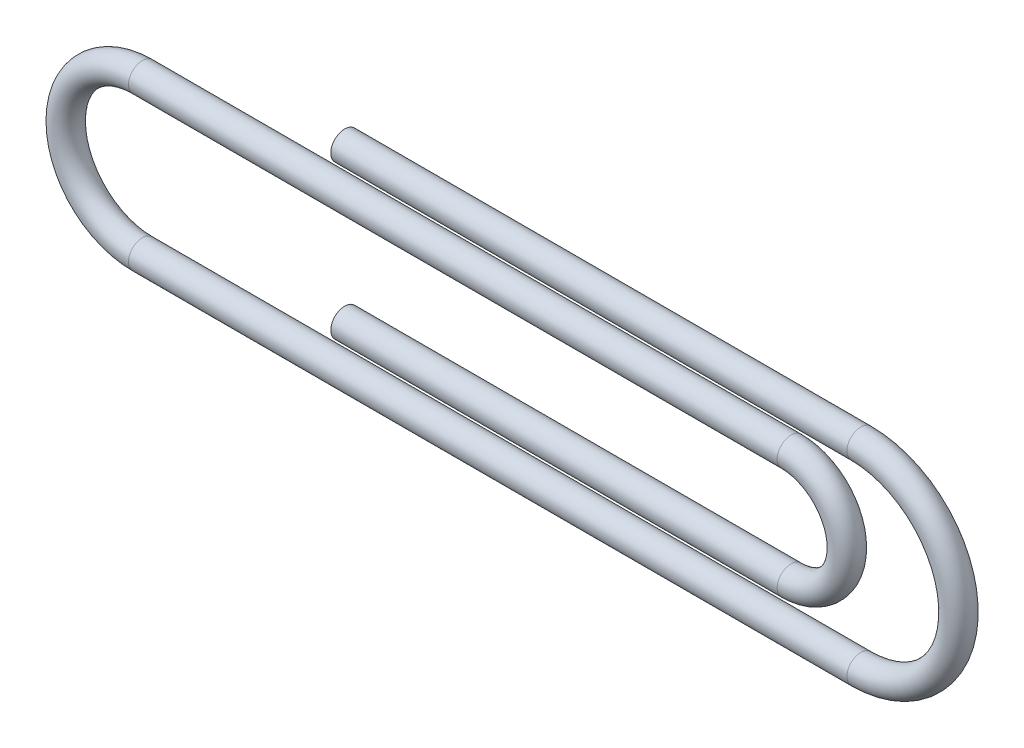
from build123d import *

# Parameters (mm, degrees)
SKETCH2_R = 0.5


with BuildPart() as part:
    # Sweep1: sweep along a path in Sketch1
    with BuildLine(Plane.XY) as sweep1_path:
        Line((0, 0), (18.5, 0))
        ThreePointArc((18.5, 0), (22, -3.5), (18.5, -7))
        Line((18.5, -7), (-7.25, -7))
        ThreePointArc((-7.25, -7), (-10, -4.25), (-7.25, -1.5))
        Line((-7.25, -1.5), (16, -1.5))
        ThreePointArc((16, -1.5), (18, -3.5), (16, -5.5))
        Line((16, -5.5), (0, -5.5))
    # Sketch2 → Sweep1 (sweep)
    with BuildSketch(Plane(origin=(0, 0, 0), x_dir=(0, 0, -1), z_dir=(1, 0, 0))):
        Circle(SKETCH2_R)
    sweep(path=sweep1_path.line)


solid = part.part
